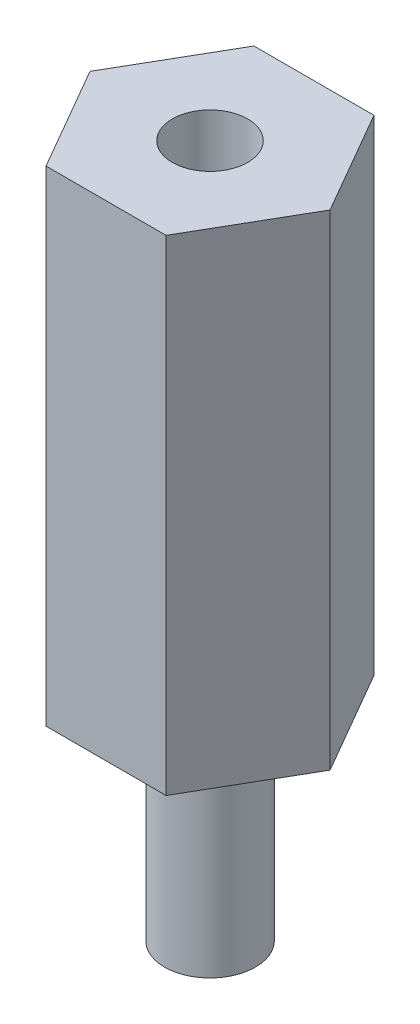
from build123d import *

# Parameters (mm, degrees)
BASE_EXTRUDE_DEPTH        = 22.225
SKETCH2_R                 = 2.0828
EXTRUDE1_DEPTH            = 9.525
F_8_32_TAPPED_HOLE1_D     = 3.4544
F_8_32_TAPPED_HOLE1_DEPTH = 13.8684
F_8_32_TAPPED_HOLE1_TIP   = 1.037806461


with BuildPart() as part:
    # Sketch1 → Base-Extrude (new body)
    with BuildSketch(Plane(origin=(0, 0, 0), x_dir=(1, 0, 0), z_dir=(0, 1, 0))):
        Polygon((5.499261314, 0), (2.749630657, 4.7625), (-2.749630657, 4.7625), (-5.499261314, 0), (-2.749630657, -4.7625), (2.749630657, -4.7625), align=None)
    extrude(amount=BASE_EXTRUDE_DEPTH)

    # Sketch2 → Extrude1 (add)
    with BuildSketch(Plane.XZ):
        with Locations(Location((0, 0, 0), (0, 0, 90))):
            Circle(SKETCH2_R)
    extrude(amount=EXTRUDE1_DEPTH)

    # 8-32 Tapped Hole1
    with Locations(Plane(origin=(0, 22.225, 0), x_dir=(-1, 0, 0), z_dir=(0, 1, 0))):
        with Locations((0, 0)):
            Hole(F_8_32_TAPPED_HOLE1_D / 2, depth=F_8_32_TAPPED_HOLE1_DEPTH)
            with Locations((0, 0, -(F_8_32_TAPPED_HOLE1_DEPTH + F_8_32_TAPPED_HOLE1_TIP / 2))):  # 118° drill point
                Cone(0, F_8_32_TAPPED_HOLE1_D / 2, F_8_32_TAPPED_HOLE1_TIP, mode=Mode.SUBTRACT)


solid = part.part
